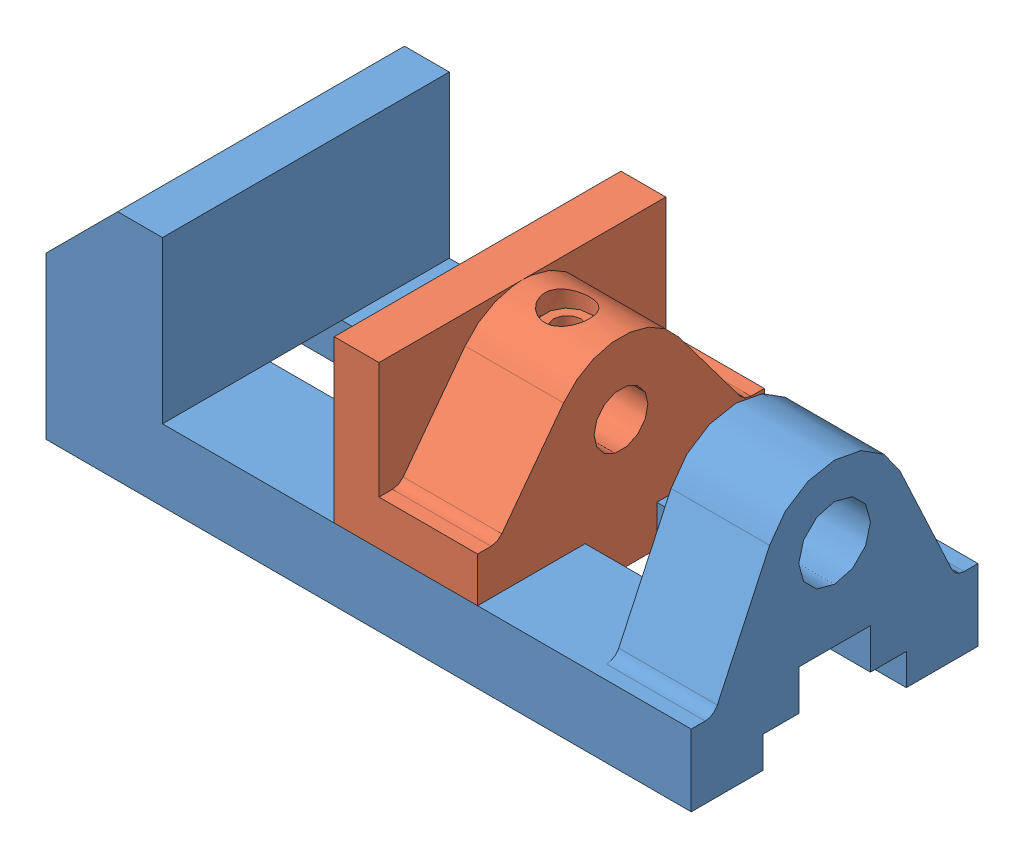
SolidWorks assembly Assem3.SLDASM, configuration Default (file format 6000). Lengths in mm.
Overall size (144 52 64).
2 component instances, 2 part files, 3 mates.
Components (placement in the parent):
- vice-body-1: vice-body.SLDPRT [Default] at (-165.9369 -6.4769 36.3055) size (144 52 64)
- vice-jaw-1: vice-jaw.SLDPRT [Default] at (-101.6145 23.5231 36.3055) x (0 0 -1) z (1 0 0) size (64 45 32)
Mates (geometry in assembly coordinates):
- Coincident11: coincident: plane of vice-body-1 through (-165.9369 0.5231 28.3055) normal (0 0 1); plane of vice-jaw-1 through (-69.6145 38.102 20.4649) normal (1 0 0)
- Coincident21: coincident: plane of vice-body-1 through (-21.9369 9.5231 68.3055) normal (0 1 0); plane of vice-jaw-1 through (-45.6145 38.102 20.4649) normal (0 -1 0)
- Parallel11: parallel: plane of vice-body-1 through (-139.9369 9.5231 68.3055) normal (1 0 0); plane of vice-jaw-1 through (-45.6145 29.102 -11.5351) normal (0 0 -1)
